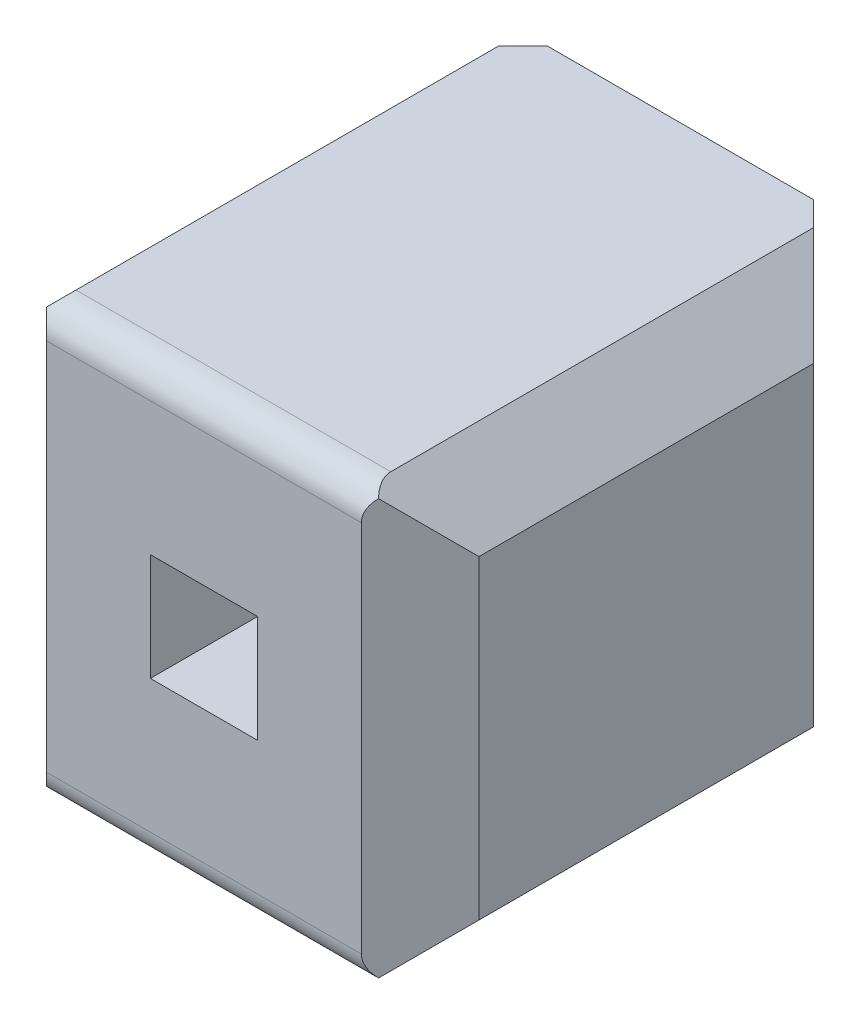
from build123d import *

# Parameters (mm, degrees)
BOSS_EXTRUDE1_DEPTH = 1.54
BOSS_EXTRUDE2_DEPTH = 0.5
SKETCH3_W           = 2.54
SKETCH3_H           = 2.04
BOSS_EXTRUDE3_DEPTH = 2.309999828
BOSS_EXTRUDE4_DEPTH = 0.5
SKETCH5_W           = 0.63
SKETCH5_H           = 0.63
CUT_EXTRUDE1_DEPTH  = 30.371228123
CHAMFER1_SIZE       = 0.345477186
FILLET1_R           = 0.172738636


with BuildPart() as part:
    # Sketch1 → Boss-Extrude1 (new body)
    with BuildSketch(Plane.XZ.offset(0.77)):
        Polygon((29.019999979, 0.299999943), (29.21, 0.49), (26.67, 0.49), (26.86, 0.299999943), align=None)
    extrude(amount=-BOSS_EXTRUDE1_DEPTH)

    # Sketch2 → Boss-Extrude2 (add)
    with BuildSketch(Plane(origin=(0, 0.77, 0), x_dir=(-1, 0, 0), z_dir=(0, 1, 0))):
        Polygon((-26.67, 0.49), (-27.158578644, 0.001421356), (-28.721421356, 0.001421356), (-29.21, 0.49), align=None)
    extrude(amount=BOSS_EXTRUDE2_DEPTH)

    # Sketch3 → Boss-Extrude3 (add)
    with BuildSketch(Plane.XY.offset(0.49)):
        with Locations((27.94, 0.25)):
            Rectangle(SKETCH3_W, SKETCH3_H)
    extrude(amount=BOSS_EXTRUDE3_DEPTH)

    # Sketch4 → Boss-Extrude4 (add)
    with BuildSketch(Plane.XZ.offset(0.77)):
        Polygon((29.21, 0.49), (28.721421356, 0.001421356), (27.158578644, 0.001421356), (26.67, 0.49), (26.67, 2.799999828), (29.21, 2.799999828), align=None)
    extrude(amount=BOSS_EXTRUDE4_DEPTH)

    # Sketch5 → Cut-Extrude1 (cut, through all)
    with BuildSketch(Plane.XY.offset(2.799999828)):
        with Locations((27.94, 0)):
            Rectangle(SKETCH5_W, SKETCH5_H)
    extrude(amount=-CUT_EXTRUDE1_DEPTH, mode=Mode.SUBTRACT)

    # Chamfer1
    chamfer1_edges = [part.edges().sort_by_distance(p)[0] for p in [
        (29.21, 1.27, 1.644999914),
        (26.67, 1.27, 1.644999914),
        (29.21, 0, 2.799999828),
        (26.67, 0, 2.799999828),
        (29.21, -1.27, 1.644999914),
        (26.67, -1.27, 1.644999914),
    ]]
    chamfer(chamfer1_edges, length=CHAMFER1_SIZE)

    # Fillet1
    fillet1_edges = [part.edges().sort_by_distance(p)[0] for p in [
        (27.94, 1.27, 2.799999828),
        (27.94, -1.27, 2.799999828),
    ]]
    fillet(fillet1_edges, radius=FILLET1_R)


solid = part.part
